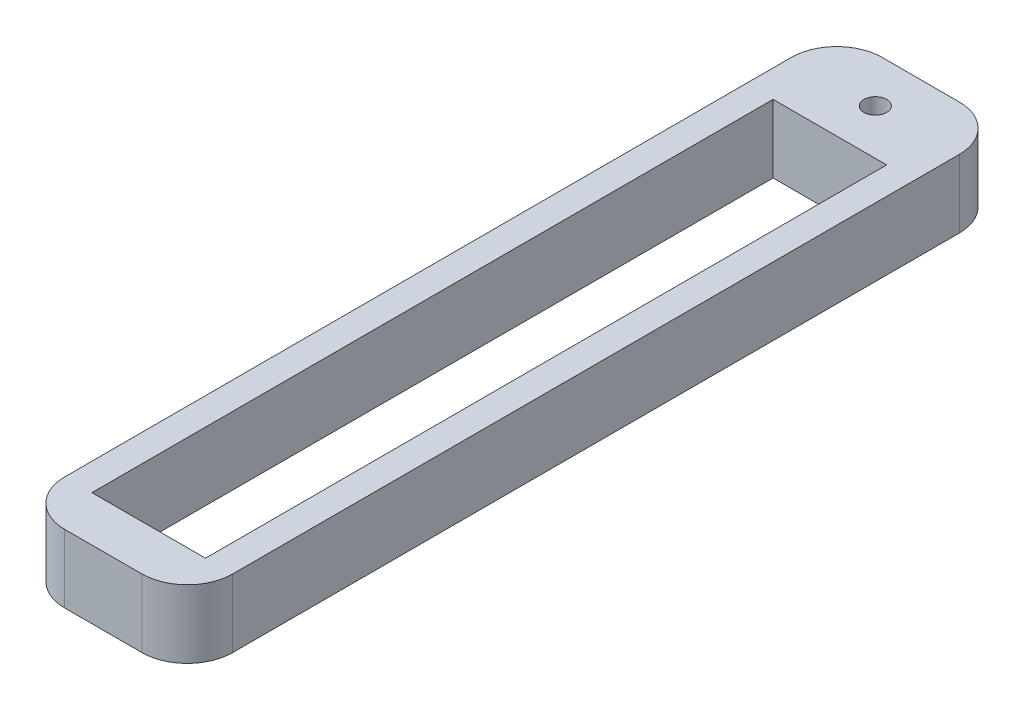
ISO-10303-21;
HEADER;
FILE_DESCRIPTION(('STEP AP214'),'2;1');
FILE_NAME('part.step','',(''),(''),'','','');
FILE_SCHEMA(('AUTOMOTIVE_DESIGN { 1 0 10303 214 1 1 1 1 }'));
ENDSEC;
DATA;
#1=APPLICATION_CONTEXT('core data for automotive mechanical design processes');
#2=APPLICATION_PROTOCOL_DEFINITION('international standard','automotive_design',2000,#1);
#3=PRODUCT_CONTEXT('',#1,'mechanical');
#4=PRODUCT('Part','Part','',(#3));
#5=PRODUCT_RELATED_PRODUCT_CATEGORY('part','',(#4));
#6=PRODUCT_DEFINITION_FORMATION('','',#4);
#7=PRODUCT_DEFINITION_CONTEXT('part definition',#1,'design');
#8=PRODUCT_DEFINITION('design','',#6,#7);
#9=PRODUCT_DEFINITION_SHAPE('','',#8);
#10=(LENGTH_UNIT() NAMED_UNIT(*) SI_UNIT(.MILLI.,.METRE.));
#11=(NAMED_UNIT(*) PLANE_ANGLE_UNIT() SI_UNIT($,.RADIAN.));
#12=(NAMED_UNIT(*) SI_UNIT($,.STERADIAN.) SOLID_ANGLE_UNIT());
#13=UNCERTAINTY_MEASURE_WITH_UNIT(LENGTH_MEASURE(1.E-05),#10,'distance_accuracy_value','');
#14=(GEOMETRIC_REPRESENTATION_CONTEXT(3) GLOBAL_UNCERTAINTY_ASSIGNED_CONTEXT((#13)) GLOBAL_UNIT_ASSIGNED_CONTEXT((#10,
#11,#12)) REPRESENTATION_CONTEXT('',''));
#15=CARTESIAN_POINT('',(0.,0.,0.));
#16=DIRECTION('',(0.,0.,1.));
#17=DIRECTION('',(1.,0.,0.));
#18=AXIS2_PLACEMENT_3D('',#15,#16,#17);
#19=CARTESIAN_POINT('',(0.799999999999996,3.,-32.));
#20=DIRECTION('',(0.,1.,0.));
#21=DIRECTION('',(0.,0.,1.));
#22=AXIS2_PLACEMENT_3D('',#19,#20,#21);
#23=PLANE('',#22);
#24=DIRECTION('',(1.,0.,0.));
#25=VECTOR('',#24,1.);
#26=CARTESIAN_POINT('',(0.,3.,0.));
#27=LINE('',#26,#25);
#28=CARTESIAN_POINT('',(0.,3.,0.));
#29=VERTEX_POINT('',#28);
#30=CARTESIAN_POINT('',(5.,3.,0.));
#31=VERTEX_POINT('',#30);
#32=EDGE_CURVE('E130',#29,#31,#27,.T.);
#33=ORIENTED_EDGE('',*,*,#32,.F.);
#34=DIRECTION('',(0.,0.,1.));
#35=VECTOR('',#34,1.);
#36=CARTESIAN_POINT('',(0.,3.,0.));
#37=LINE('',#36,#35);
#38=CARTESIAN_POINT('',(0.,3.,-30.));
#39=VERTEX_POINT('',#38);
#40=EDGE_CURVE('E122',#39,#29,#37,.T.);
#41=ORIENTED_EDGE('',*,*,#40,.F.);
#42=DIRECTION('',(-1.,0.,0.));
#43=VECTOR('',#42,1.);
#44=CARTESIAN_POINT('',(0.,3.,-30.));
#45=LINE('',#44,#43);
#46=CARTESIAN_POINT('',(5.,3.,-30.));
#47=VERTEX_POINT('',#46);
#48=EDGE_CURVE('E145',#47,#39,#45,.T.);
#49=ORIENTED_EDGE('',*,*,#48,.F.);
#50=DIRECTION('',(0.,0.,-1.));
#51=VECTOR('',#50,1.);
#52=CARTESIAN_POINT('',(5.,3.,0.));
#53=LINE('',#52,#51);
#54=EDGE_CURVE('E143',#31,#47,#53,.T.);
#55=ORIENTED_EDGE('',*,*,#54,.F.);
#56=EDGE_LOOP('',(#33,#41,#49,#55));
#57=FACE_BOUND('',#56,.T.);
#58=CARTESIAN_POINT('',(0.799999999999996,3.,-32.));
#59=DIRECTION('',(0.,1.,0.));
#60=DIRECTION('',(0.,0.,1.));
#61=AXIS2_PLACEMENT_3D('',#58,#59,#60);
#62=CIRCLE('',#61,2.);
#63=CARTESIAN_POINT('',(0.800000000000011,3.,-34.));
#64=VERTEX_POINT('',#63);
#65=CARTESIAN_POINT('',(-1.2,3.,-32.));
#66=VERTEX_POINT('',#65);
#67=EDGE_CURVE('E161',#64,#66,#62,.T.);
#68=ORIENTED_EDGE('',*,*,#67,.T.);
#69=DIRECTION('',(0.,0.,1.));
#70=VECTOR('',#69,1.);
#71=CARTESIAN_POINT('',(-1.2,3.,0.));
#72=LINE('',#71,#70);
#73=CARTESIAN_POINT('',(-1.2,3.,0.));
#74=VERTEX_POINT('',#73);
#75=EDGE_CURVE('E164',#66,#74,#72,.T.);
#76=ORIENTED_EDGE('',*,*,#75,.T.);
#77=CARTESIAN_POINT('',(0.8,3.,0.));
#78=DIRECTION('',(0.,1.,0.));
#79=DIRECTION('',(0.,0.,-1.));
#80=AXIS2_PLACEMENT_3D('',#77,#78,#79);
#81=CIRCLE('',#80,2.);
#82=CARTESIAN_POINT('',(0.800000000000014,3.,2.));
#83=VERTEX_POINT('',#82);
#84=EDGE_CURVE('E167',#74,#83,#81,.T.);
#85=ORIENTED_EDGE('',*,*,#84,.T.);
#86=DIRECTION('',(1.,0.,0.));
#87=VECTOR('',#86,1.);
#88=CARTESIAN_POINT('',(0.800000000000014,3.,2.));
#89=LINE('',#88,#87);
#90=CARTESIAN_POINT('',(4.19999999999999,3.,2.));
#91=VERTEX_POINT('',#90);
#92=EDGE_CURVE('E169',#83,#91,#89,.T.);
#93=ORIENTED_EDGE('',*,*,#92,.T.);
#94=CARTESIAN_POINT('',(4.2,3.,0.));
#95=DIRECTION('',(0.,1.,0.));
#96=DIRECTION('',(0.,0.,1.));
#97=AXIS2_PLACEMENT_3D('',#94,#95,#96);
#98=CIRCLE('',#97,2.);
#99=CARTESIAN_POINT('',(6.2,3.,0.));
#100=VERTEX_POINT('',#99);
#101=EDGE_CURVE('E171',#91,#100,#98,.T.);
#102=ORIENTED_EDGE('',*,*,#101,.T.);
#103=DIRECTION('',(0.,0.,-1.));
#104=VECTOR('',#103,1.);
#105=CARTESIAN_POINT('',(6.2,3.,0.));
#106=LINE('',#105,#104);
#107=CARTESIAN_POINT('',(6.2,3.,-32.));
#108=VERTEX_POINT('',#107);
#109=EDGE_CURVE('E173',#100,#108,#106,.T.);
#110=ORIENTED_EDGE('',*,*,#109,.T.);
#111=CARTESIAN_POINT('',(4.2,3.,-32.));
#112=DIRECTION('',(0.,1.,0.));
#113=DIRECTION('',(0.,0.,1.));
#114=AXIS2_PLACEMENT_3D('',#111,#112,#113);
#115=CIRCLE('',#114,2.);
#116=CARTESIAN_POINT('',(4.19999999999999,3.,-34.));
#117=VERTEX_POINT('',#116);
#118=EDGE_CURVE('E175',#108,#117,#115,.T.);
#119=ORIENTED_EDGE('',*,*,#118,.T.);
#120=DIRECTION('',(-1.,0.,0.));
#121=VECTOR('',#120,1.);
#122=CARTESIAN_POINT('',(0.800000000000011,3.,-34.));
#123=LINE('',#122,#121);
#124=EDGE_CURVE('E177',#117,#64,#123,.T.);
#125=ORIENTED_EDGE('',*,*,#124,.T.);
#126=EDGE_LOOP('',(#68,#76,#85,#93,#102,#110,#119,#125));
#127=FACE_BOUND('',#126,.T.);
#128=CARTESIAN_POINT('',(2.5,3.,-32.));
#129=DIRECTION('',(0.,1.,0.));
#130=DIRECTION('',(0.,0.,1.));
#131=AXIS2_PLACEMENT_3D('',#128,#129,#130);
#132=CIRCLE('',#131,0.5);
#133=CARTESIAN_POINT('',(2.5,3.,-31.5));
#134=VERTEX_POINT('',#133);
#135=EDGE_CURVE('E151',#134,#134,#132,.T.);
#136=ORIENTED_EDGE('',*,*,#135,.F.);
#137=EDGE_LOOP('',(#136));
#138=FACE_BOUND('',#137,.T.);
#139=ADVANCED_FACE('F33',(#57,#127,#138),#23,.T.);
#140=CARTESIAN_POINT('',(0.799999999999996,0.,-32.));
#141=DIRECTION('',(0.,1.,0.));
#142=DIRECTION('',(0.,0.,1.));
#143=AXIS2_PLACEMENT_3D('',#140,#141,#142);
#144=PLANE('',#143);
#145=CARTESIAN_POINT('',(0.799999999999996,0.,-32.));
#146=DIRECTION('',(0.,1.,0.));
#147=DIRECTION('',(0.,0.,1.));
#148=AXIS2_PLACEMENT_3D('',#145,#146,#147);
#149=CIRCLE('',#148,2.);
#150=CARTESIAN_POINT('',(0.800000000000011,0.,-34.));
#151=VERTEX_POINT('',#150);
#152=CARTESIAN_POINT('',(-1.2,0.,-32.));
#153=VERTEX_POINT('',#152);
#154=EDGE_CURVE('E138',#151,#153,#149,.T.);
#155=ORIENTED_EDGE('',*,*,#154,.F.);
#156=DIRECTION('',(-1.,0.,0.));
#157=VECTOR('',#156,1.);
#158=CARTESIAN_POINT('',(0.800000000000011,0.,-34.));
#159=LINE('',#158,#157);
#160=CARTESIAN_POINT('',(4.19999999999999,0.,-34.));
#161=VERTEX_POINT('',#160);
#162=EDGE_CURVE('E165',#161,#151,#159,.T.);
#163=ORIENTED_EDGE('',*,*,#162,.F.);
#164=CARTESIAN_POINT('',(4.2,0.,-32.));
#165=DIRECTION('',(0.,1.,0.));
#166=DIRECTION('',(0.,0.,1.));
#167=AXIS2_PLACEMENT_3D('',#164,#165,#166);
#168=CIRCLE('',#167,2.);
#169=CARTESIAN_POINT('',(6.2,0.,-32.));
#170=VERTEX_POINT('',#169);
#171=EDGE_CURVE('E192',#170,#161,#168,.T.);
#172=ORIENTED_EDGE('',*,*,#171,.F.);
#173=DIRECTION('',(0.,0.,-1.));
#174=VECTOR('',#173,1.);
#175=CARTESIAN_POINT('',(6.2,0.,0.));
#176=LINE('',#175,#174);
#177=CARTESIAN_POINT('',(6.2,0.,0.));
#178=VERTEX_POINT('',#177);
#179=EDGE_CURVE('E190',#178,#170,#176,.T.);
#180=ORIENTED_EDGE('',*,*,#179,.F.);
#181=CARTESIAN_POINT('',(4.2,0.,0.));
#182=DIRECTION('',(0.,1.,0.));
#183=DIRECTION('',(0.,0.,1.));
#184=AXIS2_PLACEMENT_3D('',#181,#182,#183);
#185=CIRCLE('',#184,2.);
#186=CARTESIAN_POINT('',(4.19999999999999,0.,2.));
#187=VERTEX_POINT('',#186);
#188=EDGE_CURVE('E188',#187,#178,#185,.T.);
#189=ORIENTED_EDGE('',*,*,#188,.F.);
#190=DIRECTION('',(1.,0.,0.));
#191=VECTOR('',#190,1.);
#192=CARTESIAN_POINT('',(0.800000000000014,0.,2.));
#193=LINE('',#192,#191);
#194=CARTESIAN_POINT('',(0.800000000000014,0.,2.));
#195=VERTEX_POINT('',#194);
#196=EDGE_CURVE('E186',#195,#187,#193,.T.);
#197=ORIENTED_EDGE('',*,*,#196,.F.);
#198=CARTESIAN_POINT('',(0.8,0.,0.));
#199=DIRECTION('',(0.,1.,0.));
#200=DIRECTION('',(0.,0.,-1.));
#201=AXIS2_PLACEMENT_3D('',#198,#199,#200);
#202=CIRCLE('',#201,2.);
#203=CARTESIAN_POINT('',(-1.2,0.,0.));
#204=VERTEX_POINT('',#203);
#205=EDGE_CURVE('E184',#204,#195,#202,.T.);
#206=ORIENTED_EDGE('',*,*,#205,.F.);
#207=DIRECTION('',(0.,0.,1.));
#208=VECTOR('',#207,1.);
#209=CARTESIAN_POINT('',(-1.2,0.,0.));
#210=LINE('',#209,#208);
#211=EDGE_CURVE('E182',#153,#204,#210,.T.);
#212=ORIENTED_EDGE('',*,*,#211,.F.);
#213=EDGE_LOOP('',(#155,#163,#172,#180,#189,#197,#206,#212));
#214=FACE_BOUND('',#213,.T.);
#215=DIRECTION('',(0.,0.,1.));
#216=VECTOR('',#215,1.);
#217=CARTESIAN_POINT('',(0.,0.,0.));
#218=LINE('',#217,#216);
#219=CARTESIAN_POINT('',(0.,0.,-30.));
#220=VERTEX_POINT('',#219);
#221=CARTESIAN_POINT('',(0.,0.,0.));
#222=VERTEX_POINT('',#221);
#223=EDGE_CURVE('E56',#220,#222,#218,.T.);
#224=ORIENTED_EDGE('',*,*,#223,.T.);
#225=DIRECTION('',(1.,0.,0.));
#226=VECTOR('',#225,1.);
#227=CARTESIAN_POINT('',(0.,0.,0.));
#228=LINE('',#227,#226);
#229=CARTESIAN_POINT('',(5.,0.,0.));
#230=VERTEX_POINT('',#229);
#231=EDGE_CURVE('E137',#222,#230,#228,.T.);
#232=ORIENTED_EDGE('',*,*,#231,.T.);
#233=DIRECTION('',(0.,0.,-1.));
#234=VECTOR('',#233,1.);
#235=CARTESIAN_POINT('',(5.,0.,0.));
#236=LINE('',#235,#234);
#237=CARTESIAN_POINT('',(5.,0.,-30.));
#238=VERTEX_POINT('',#237);
#239=EDGE_CURVE('E153',#230,#238,#236,.T.);
#240=ORIENTED_EDGE('',*,*,#239,.T.);
#241=DIRECTION('',(-1.,0.,0.));
#242=VECTOR('',#241,1.);
#243=CARTESIAN_POINT('',(0.,0.,-30.));
#244=LINE('',#243,#242);
#245=EDGE_CURVE('E131',#238,#220,#244,.T.);
#246=ORIENTED_EDGE('',*,*,#245,.T.);
#247=EDGE_LOOP('',(#224,#232,#240,#246));
#248=FACE_BOUND('',#247,.T.);
#249=CARTESIAN_POINT('',(2.5,0.,-32.));
#250=DIRECTION('',(0.,1.,0.));
#251=DIRECTION('',(0.,0.,1.));
#252=AXIS2_PLACEMENT_3D('',#249,#250,#251);
#253=CIRCLE('',#252,0.5);
#254=CARTESIAN_POINT('',(2.5,0.,-31.5));
#255=VERTEX_POINT('',#254);
#256=EDGE_CURVE('E297',#255,#255,#253,.T.);
#257=ORIENTED_EDGE('',*,*,#256,.T.);
#258=EDGE_LOOP('',(#257));
#259=FACE_BOUND('',#258,.T.);
#260=ADVANCED_FACE('F222',(#214,#248,#259),#144,.F.);
#261=CARTESIAN_POINT('',(0.799999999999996,3.,-32.));
#262=DIRECTION('',(0.,-1.,0.));
#263=DIRECTION('',(0.,0.,-1.));
#264=AXIS2_PLACEMENT_3D('',#261,#262,#263);
#265=CYLINDRICAL_SURFACE('',#264,2.);
#266=ORIENTED_EDGE('',*,*,#154,.T.);
#267=DIRECTION('',(0.,-1.,0.));
#268=VECTOR('',#267,1.);
#269=CARTESIAN_POINT('',(-1.2,3.,-32.));
#270=LINE('',#269,#268);
#271=EDGE_CURVE('E11',#66,#153,#270,.T.);
#272=ORIENTED_EDGE('',*,*,#271,.F.);
#273=ORIENTED_EDGE('',*,*,#67,.F.);
#274=DIRECTION('',(0.,-1.,0.));
#275=VECTOR('',#274,1.);
#276=CARTESIAN_POINT('',(0.800000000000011,3.,-34.));
#277=LINE('',#276,#275);
#278=EDGE_CURVE('E179',#64,#151,#277,.T.);
#279=ORIENTED_EDGE('',*,*,#278,.T.);
#280=EDGE_LOOP('',(#266,#272,#273,#279));
#281=FACE_BOUND('',#280,.T.);
#282=ADVANCED_FACE('F35',(#281),#265,.T.);
#283=CARTESIAN_POINT('',(-1.2,3.,0.));
#284=DIRECTION('',(1.,0.,0.));
#285=DIRECTION('',(0.,0.,-1.));
#286=AXIS2_PLACEMENT_3D('',#283,#284,#285);
#287=PLANE('',#286);
#288=ORIENTED_EDGE('',*,*,#211,.T.);
#289=DIRECTION('',(0.,-1.,0.));
#290=VECTOR('',#289,1.);
#291=CARTESIAN_POINT('',(-1.2,3.,0.));
#292=LINE('',#291,#290);
#293=EDGE_CURVE('E41',#74,#204,#292,.T.);
#294=ORIENTED_EDGE('',*,*,#293,.F.);
#295=ORIENTED_EDGE('',*,*,#75,.F.);
#296=ORIENTED_EDGE('',*,*,#271,.T.);
#297=EDGE_LOOP('',(#288,#294,#295,#296));
#298=FACE_BOUND('',#297,.T.);
#299=ADVANCED_FACE('F239',(#298),#287,.F.);
#300=CARTESIAN_POINT('',(0.8,3.,0.));
#301=DIRECTION('',(0.,-1.,0.));
#302=DIRECTION('',(0.,0.,-1.));
#303=AXIS2_PLACEMENT_3D('',#300,#301,#302);
#304=CYLINDRICAL_SURFACE('',#303,2.);
#305=ORIENTED_EDGE('',*,*,#205,.T.);
#306=DIRECTION('',(0.,-1.,0.));
#307=VECTOR('',#306,1.);
#308=CARTESIAN_POINT('',(0.800000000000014,3.,2.));
#309=LINE('',#308,#307);
#310=EDGE_CURVE('E209',#83,#195,#309,.T.);
#311=ORIENTED_EDGE('',*,*,#310,.F.);
#312=ORIENTED_EDGE('',*,*,#84,.F.);
#313=ORIENTED_EDGE('',*,*,#293,.T.);
#314=EDGE_LOOP('',(#305,#311,#312,#313));
#315=FACE_BOUND('',#314,.T.);
#316=ADVANCED_FACE('F216',(#315),#304,.T.);
#317=CARTESIAN_POINT('',(0.800000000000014,3.,2.));
#318=DIRECTION('',(0.,0.,-1.));
#319=DIRECTION('',(-1.,0.,0.));
#320=AXIS2_PLACEMENT_3D('',#317,#318,#319);
#321=PLANE('',#320);
#322=ORIENTED_EDGE('',*,*,#196,.T.);
#323=DIRECTION('',(0.,-1.,0.));
#324=VECTOR('',#323,1.);
#325=CARTESIAN_POINT('',(4.19999999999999,3.,2.));
#326=LINE('',#325,#324);
#327=EDGE_CURVE('E206',#91,#187,#326,.T.);
#328=ORIENTED_EDGE('',*,*,#327,.F.);
#329=ORIENTED_EDGE('',*,*,#92,.F.);
#330=ORIENTED_EDGE('',*,*,#310,.T.);
#331=EDGE_LOOP('',(#322,#328,#329,#330));
#332=FACE_BOUND('',#331,.T.);
#333=ADVANCED_FACE('F228',(#332),#321,.F.);
#334=CARTESIAN_POINT('',(4.2,3.,0.));
#335=DIRECTION('',(0.,-1.,0.));
#336=DIRECTION('',(0.,0.,-1.));
#337=AXIS2_PLACEMENT_3D('',#334,#335,#336);
#338=CYLINDRICAL_SURFACE('',#337,2.);
#339=ORIENTED_EDGE('',*,*,#188,.T.);
#340=DIRECTION('',(0.,-1.,0.));
#341=VECTOR('',#340,1.);
#342=CARTESIAN_POINT('',(6.2,3.,0.));
#343=LINE('',#342,#341);
#344=EDGE_CURVE('E203',#100,#178,#343,.T.);
#345=ORIENTED_EDGE('',*,*,#344,.F.);
#346=ORIENTED_EDGE('',*,*,#101,.F.);
#347=ORIENTED_EDGE('',*,*,#327,.T.);
#348=EDGE_LOOP('',(#339,#345,#346,#347));
#349=FACE_BOUND('',#348,.T.);
#350=ADVANCED_FACE('F232',(#349),#338,.T.);
#351=CARTESIAN_POINT('',(6.2,3.,0.));
#352=DIRECTION('',(-1.,0.,0.));
#353=DIRECTION('',(0.,0.,1.));
#354=AXIS2_PLACEMENT_3D('',#351,#352,#353);
#355=PLANE('',#354);
#356=ORIENTED_EDGE('',*,*,#179,.T.);
#357=DIRECTION('',(0.,-1.,0.));
#358=VECTOR('',#357,1.);
#359=CARTESIAN_POINT('',(6.2,3.,-32.));
#360=LINE('',#359,#358);
#361=EDGE_CURVE('E200',#108,#170,#360,.T.);
#362=ORIENTED_EDGE('',*,*,#361,.F.);
#363=ORIENTED_EDGE('',*,*,#109,.F.);
#364=ORIENTED_EDGE('',*,*,#344,.T.);
#365=EDGE_LOOP('',(#356,#362,#363,#364));
#366=FACE_BOUND('',#365,.T.);
#367=ADVANCED_FACE('F252',(#366),#355,.F.);
#368=CARTESIAN_POINT('',(4.2,3.,-32.));
#369=DIRECTION('',(0.,-1.,0.));
#370=DIRECTION('',(0.,0.,-1.));
#371=AXIS2_PLACEMENT_3D('',#368,#369,#370);
#372=CYLINDRICAL_SURFACE('',#371,2.);
#373=ORIENTED_EDGE('',*,*,#171,.T.);
#374=DIRECTION('',(0.,-1.,0.));
#375=VECTOR('',#374,1.);
#376=CARTESIAN_POINT('',(4.19999999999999,3.,-34.));
#377=LINE('',#376,#375);
#378=EDGE_CURVE('E197',#117,#161,#377,.T.);
#379=ORIENTED_EDGE('',*,*,#378,.F.);
#380=ORIENTED_EDGE('',*,*,#118,.F.);
#381=ORIENTED_EDGE('',*,*,#361,.T.);
#382=EDGE_LOOP('',(#373,#379,#380,#381));
#383=FACE_BOUND('',#382,.T.);
#384=ADVANCED_FACE('F250',(#383),#372,.T.);
#385=CARTESIAN_POINT('',(0.800000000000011,3.,-34.));
#386=DIRECTION('',(0.,0.,1.));
#387=DIRECTION('',(1.,0.,0.));
#388=AXIS2_PLACEMENT_3D('',#385,#386,#387);
#389=PLANE('',#388);
#390=ORIENTED_EDGE('',*,*,#162,.T.);
#391=ORIENTED_EDGE('',*,*,#278,.F.);
#392=ORIENTED_EDGE('',*,*,#124,.F.);
#393=ORIENTED_EDGE('',*,*,#378,.T.);
#394=EDGE_LOOP('',(#390,#391,#392,#393));
#395=FACE_BOUND('',#394,.T.);
#396=ADVANCED_FACE('F245',(#395),#389,.F.);
#397=CARTESIAN_POINT('',(0.,3.,0.));
#398=DIRECTION('',(1.,0.,0.));
#399=DIRECTION('',(0.,0.,-1.));
#400=AXIS2_PLACEMENT_3D('',#397,#398,#399);
#401=PLANE('',#400);
#402=ORIENTED_EDGE('',*,*,#223,.F.);
#403=DIRECTION('',(0.,-1.,0.));
#404=VECTOR('',#403,1.);
#405=CARTESIAN_POINT('',(0.,3.,-30.));
#406=LINE('',#405,#404);
#407=EDGE_CURVE('E126',#39,#220,#406,.T.);
#408=ORIENTED_EDGE('',*,*,#407,.F.);
#409=ORIENTED_EDGE('',*,*,#40,.T.);
#410=DIRECTION('',(0.,-1.,0.));
#411=VECTOR('',#410,1.);
#412=CARTESIAN_POINT('',(0.,3.,0.));
#413=LINE('',#412,#411);
#414=EDGE_CURVE('E125',#29,#222,#413,.T.);
#415=ORIENTED_EDGE('',*,*,#414,.T.);
#416=EDGE_LOOP('',(#402,#408,#409,#415));
#417=FACE_BOUND('',#416,.T.);
#418=ADVANCED_FACE('F124',(#417),#401,.T.);
#419=CARTESIAN_POINT('',(0.,3.,0.));
#420=DIRECTION('',(0.,0.,-1.));
#421=DIRECTION('',(-1.,0.,0.));
#422=AXIS2_PLACEMENT_3D('',#419,#420,#421);
#423=PLANE('',#422);
#424=ORIENTED_EDGE('',*,*,#231,.F.);
#425=ORIENTED_EDGE('',*,*,#414,.F.);
#426=ORIENTED_EDGE('',*,*,#32,.T.);
#427=DIRECTION('',(0.,-1.,0.));
#428=VECTOR('',#427,1.);
#429=CARTESIAN_POINT('',(5.,3.,0.));
#430=LINE('',#429,#428);
#431=EDGE_CURVE('E139',#31,#230,#430,.T.);
#432=ORIENTED_EDGE('',*,*,#431,.T.);
#433=EDGE_LOOP('',(#424,#425,#426,#432));
#434=FACE_BOUND('',#433,.T.);
#435=ADVANCED_FACE('F134',(#434),#423,.T.);
#436=CARTESIAN_POINT('',(5.,3.,0.));
#437=DIRECTION('',(-1.,0.,0.));
#438=DIRECTION('',(0.,0.,1.));
#439=AXIS2_PLACEMENT_3D('',#436,#437,#438);
#440=PLANE('',#439);
#441=ORIENTED_EDGE('',*,*,#239,.F.);
#442=ORIENTED_EDGE('',*,*,#431,.F.);
#443=ORIENTED_EDGE('',*,*,#54,.T.);
#444=DIRECTION('',(0.,-1.,0.));
#445=VECTOR('',#444,1.);
#446=CARTESIAN_POINT('',(5.,3.,-30.));
#447=LINE('',#446,#445);
#448=EDGE_CURVE('E48',#47,#238,#447,.T.);
#449=ORIENTED_EDGE('',*,*,#448,.T.);
#450=EDGE_LOOP('',(#441,#442,#443,#449));
#451=FACE_BOUND('',#450,.T.);
#452=ADVANCED_FACE('F277',(#451),#440,.T.);
#453=CARTESIAN_POINT('',(0.,3.,-30.));
#454=DIRECTION('',(0.,0.,1.));
#455=DIRECTION('',(1.,0.,0.));
#456=AXIS2_PLACEMENT_3D('',#453,#454,#455);
#457=PLANE('',#456);
#458=ORIENTED_EDGE('',*,*,#245,.F.);
#459=ORIENTED_EDGE('',*,*,#448,.F.);
#460=ORIENTED_EDGE('',*,*,#48,.T.);
#461=ORIENTED_EDGE('',*,*,#407,.T.);
#462=EDGE_LOOP('',(#458,#459,#460,#461));
#463=FACE_BOUND('',#462,.T.);
#464=ADVANCED_FACE('F281',(#463),#457,.T.);
#465=CARTESIAN_POINT('',(2.5,3.,-32.));
#466=DIRECTION('',(0.,-1.,0.));
#467=DIRECTION('',(0.,0.,-1.));
#468=AXIS2_PLACEMENT_3D('',#465,#466,#467);
#469=CYLINDRICAL_SURFACE('',#468,0.5);
#470=ORIENTED_EDGE('',*,*,#135,.T.);
#471=EDGE_LOOP('',(#470));
#472=FACE_BOUND('',#471,.T.);
#473=ORIENTED_EDGE('',*,*,#256,.F.);
#474=EDGE_LOOP('',(#473));
#475=FACE_BOUND('',#474,.T.);
#476=ADVANCED_FACE('F287',(#472,#475),#469,.F.);
#477=CLOSED_SHELL('',(#139,#260,#282,#299,#316,#333,#350,#367,#384,#396,#418,#435,#452,#464,#476));
#478=MANIFOLD_SOLID_BREP('B2',#477);
#479=ADVANCED_BREP_SHAPE_REPRESENTATION('',(#18,#478),#14);
#480=SHAPE_DEFINITION_REPRESENTATION(#9,#479);
ENDSEC;
END-ISO-10303-21;
